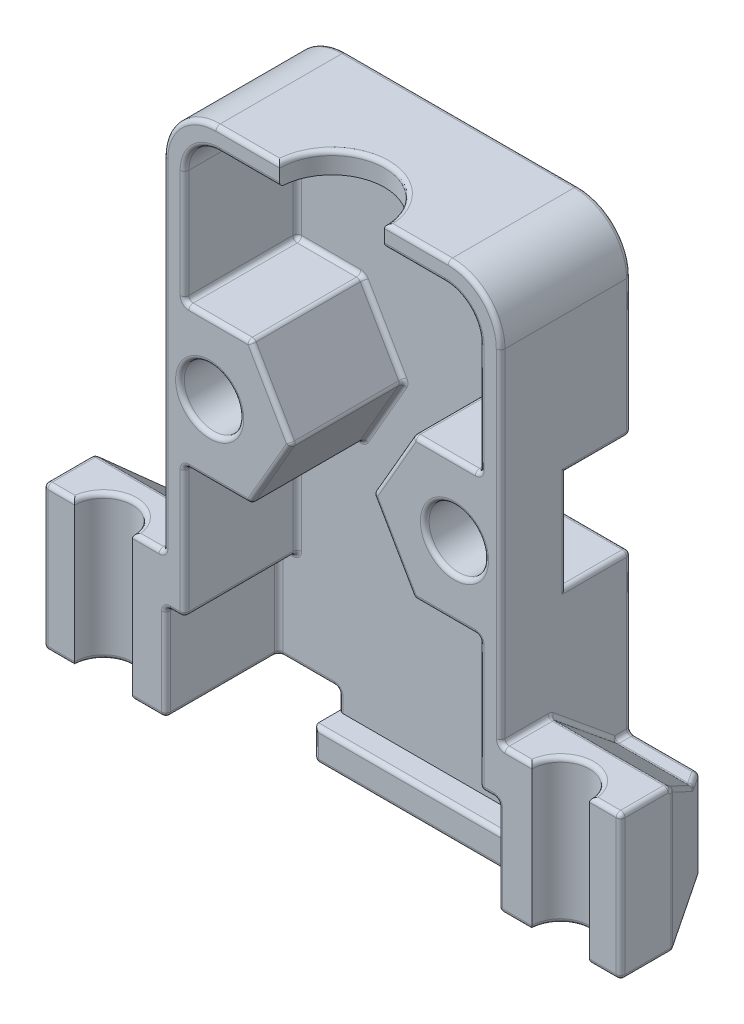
from build123d import *

# Parameters (mm, degrees)
EXTRUDE1_DEPTH      = 7.45
EXTRUDE2_DEPTH      = 31.906239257
EXTRUDE3_DEPTH      = 6.860458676
EXTRUDE4_DEPTH      = 6.860458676
EXTRUDE6_DEPTH      = 0.8
SKETCH6_R           = 1.65
SKETCH6_R_2         = 3
EXTRUDE7_DEPTH      = 39.254966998
SKETCH7_W           = 16.879082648
SKETCH7_H           = 29.6
EXTRUDE8_DEPTH      = 6.45
FILLET1_R           = 3
EXTRUDE9_DEPTH      = 7.45
EXTRUDE10_DEPTH     = 3.7
SKETCH12_R          = 1.7
EXTRUDE11_DEPTH     = 26.405019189
SKETCH_1_W          = 19
SKETCH_1_H          = 5.5
CUT_EXTRUDE_1_DEPTH = 6.45
FILLET_1_R          = 2
CUT_EXTRUDE_2_DEPTH = 36.726635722
CUT_EXTRUDE_3_DEPTH = 36.726635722
FILLET4_R           = 0.25


with BuildPart() as part:
    # Sketch1 → Extrude1 (new body)
    with BuildSketch(Plane.XY):
        Polygon((-16.5, -3.6), (-9.639541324, -3.6), (-9.639541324, 19.75), (9.639541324, 19.75), (9.639541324, -3.6), (16.5, -3.6), (16.5, -11.85), (6.075, -11.85), (6.075, -14.75), (-6.075, -14.75), (-6.075, -11.85), (-16.5, -11.85), align=None)
    extrude(amount=EXTRUDE1_DEPTH)

    # Sketch2 → Extrude2 (cut, through all)
    with BuildSketch(Plane.ZY.offset(6.075)):
        Polygon((7.45, -14.75), (2.4, -14.75), (2.4, -12.95), (1, -12.95), (1, -11.85), (2.4, -11.85), (7.45, -11.85), align=None)
    extrude(amount=-EXTRUDE2_DEPTH, mode=Mode.SUBTRACT)

    # Sketch3 → Extrude3 (cut)
    with BuildSketch(Plane.ZY.offset(16.5)):
        Polygon((0, -6.6), (1, -6.6), (4.65, -3.6), (0, -3.6), align=None)
    extrude(amount=-EXTRUDE3_DEPTH, mode=Mode.SUBTRACT)

    # Sketch4 → Extrude4 (cut)
    with BuildSketch(Plane(origin=(16.5, 0, 0), x_dir=(0, 0, -1), z_dir=(1, 0, 0))):
        Polygon((0, -6.6), (0, -3.6), (-4.65, -3.6), (-1, -6.6), align=None)
    extrude(amount=-EXTRUDE4_DEPTH, mode=Mode.SUBTRACT)

    # Sketch5 → Extrude6 (cut)
    with BuildSketch(Plane(origin=(0, 19.75, 0), x_dir=(1, 0, 0), z_dir=(0, 1, 0))):
        with BuildLine():
            ThreePointArc((-3.5, -7.45), (-2.474873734, -4.975126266), (0, -3.95))
            Line((0, -3.95), (0, 0))
            Line((0, 0), (-9.639541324, 0))
            Line((-9.639541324, 0), (-9.639541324, -7.45))
            Line((-9.639541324, -7.45), (-3.5, -7.45))
        make_face()
        with BuildLine():
            Line((0, 0), (0, -3.95))
            ThreePointArc((0, -3.95), (2.474873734, -4.975126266), (3.5, -7.45))
            Line((3.5, -7.45), (9.639541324, -7.45))
            Line((9.639541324, -7.45), (9.639541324, 0))
            Line((9.639541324, 0), (0, 0))
        make_face()
        with BuildLine():
            Line((-3, -7.45), (0, -7.45))
            Line((0, -7.45), (0, -4.45))
            ThreePointArc((0, -4.45), (-2.121320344, -5.328679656), (-3, -7.45))
        make_face()
        with BuildLine():
            Line((0, -4.45), (0, -7.45))
            Line((0, -7.45), (3, -7.45))
            ThreePointArc((3, -7.45), (2.121320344, -5.328679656), (0, -4.45))
        make_face()
        with BuildLine():
            Line((-3, -7.45), (0, -7.45))
            Line((0, -7.45), (0, -4.45))
            ThreePointArc((0, -4.45), (-2.121320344, -5.328679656), (-3, -7.45))
        make_face()
        with BuildLine():
            Line((0, -4.45), (0, -7.45))
            Line((0, -7.45), (3, -7.45))
            ThreePointArc((3, -7.45), (2.121320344, -5.328679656), (0, -4.45))
        make_face()
        with BuildLine():
            ThreePointArc((-3, -7.45), (-2.121320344, -5.328679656), (0, -4.45))
            Line((0, -4.45), (0, -3.95))
            ThreePointArc((0, -3.95), (-2.474873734, -4.975126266), (-3.5, -7.45))
            Line((-3.5, -7.45), (-3, -7.45))
        make_face()
        with BuildLine():
            Line((0, -3.95), (0, -4.45))
            ThreePointArc((0, -4.45), (2.121320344, -5.328679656), (3, -7.45))
            Line((3, -7.45), (3.5, -7.45))
            ThreePointArc((3.5, -7.45), (2.474873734, -4.975126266), (0, -3.95))
        make_face()
        with BuildLine():
            ThreePointArc((-3, -7.45), (-2.121320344, -5.328679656), (0, -4.45))
            Line((0, -4.45), (0, -3.95))
            ThreePointArc((0, -3.95), (-2.474873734, -4.975126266), (-3.5, -7.45))
            Line((-3.5, -7.45), (-3, -7.45))
        make_face()
        with BuildLine():
            Line((0, -3.95), (0, -4.45))
            ThreePointArc((0, -4.45), (2.121320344, -5.328679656), (3, -7.45))
            Line((3, -7.45), (3.5, -7.45))
            ThreePointArc((3.5, -7.45), (2.474873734, -4.975126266), (0, -3.95))
        make_face()
    extrude(amount=-EXTRUDE6_DEPTH, mode=Mode.SUBTRACT)

    # Sketch6 → Extrude7 (cut, through all)
    with BuildSketch(Plane(origin=(0, 18.95, 0), x_dir=(1, 0, 0), z_dir=(0, 1, 0))):
        with Locations((-13.069770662, -7.45)):
            Circle(SKETCH6_R)
        with Locations((0, -7.45)):
            Circle(SKETCH6_R_2)
        with Locations((13.069770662, -7.45)):
            Circle(SKETCH6_R)
    extrude(amount=-EXTRUDE7_DEPTH, mode=Mode.SUBTRACT)

    # Sketch7 → Extrude8 (cut)
    with BuildSketch(Plane.XY.offset(7.45)):
        with Locations((0, 2.95)):
            Rectangle(SKETCH7_W, SKETCH7_H)
    extrude(amount=-EXTRUDE8_DEPTH, mode=Mode.SUBTRACT)

    # Fillet1
    fillet1_edges = [part.edges().sort_by_distance(p)[0] for p in [
        (-9.639541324, 18.95, 3.725),
        (9.639541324, 18.95, 3.725),
    ]]
    fillet(fillet1_edges, radius=FILLET1_R)

    # Sketch10 → Extrude9 (add)
    with BuildSketch(Plane(origin=(0, 0, 0), x_dir=(-1, 0, 0), z_dir=(0, 0, -1))):
        Polygon((8.645448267, 2.4), (9.639541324, 2.4), (9.639541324, 8.1), (8.645448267, 8.1), (5.354551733, 8.1), (3.709103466, 5.25), (5.354551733, 2.4), align=None)
        Polygon((9.33826859, 1.2), (9.639541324, 1.2), (9.639541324, 2.4), (8.645448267, 2.4), (5.354551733, 2.4), (3.709103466, 5.25), (5.354551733, 8.1), (8.645448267, 8.1), (9.639541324, 8.1), (9.639541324, 9.3), (9.33826859, 9.3), (4.66173141, 9.3), (2.32346282, 5.25), (4.66173141, 1.2), align=None)
        Polygon((-5.354551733, 8.1), (-3.709103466, 5.25), (-5.354551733, 2.4), (-8.645448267, 2.4), (-9.639541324, 2.4), (-9.639541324, 1.2), (-9.33826859, 1.2), (-4.66173141, 1.2), (-2.32346282, 5.25), (-4.66173141, 9.3), (-9.33826859, 9.3), (-9.639541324, 9.3), (-9.639541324, 8.1), (-8.645448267, 8.1), align=None)
        Polygon((-5.354551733, 2.4), (-3.709103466, 5.25), (-5.354551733, 8.1), (-8.645448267, 8.1), (-9.639541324, 8.1), (-9.639541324, 2.4), (-8.645448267, 2.4), align=None)
    extrude(amount=-EXTRUDE9_DEPTH)

    # Sketch11 → Extrude10 (cut)
    with BuildSketch(Plane(origin=(0, 0, 0), x_dir=(-1, 0, 0), z_dir=(0, 0, -1))):
        Polygon((-9.639541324, 8.1), (-5.354551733, 8.1), (-3.709103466, 5.25), (-5.354551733, 2.4), (-9.639541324, 2.4), align=None)
        Polygon((9.639541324, 8.1), (9.639541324, 2.4), (5.354551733, 2.4), (3.709103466, 5.25), (5.354551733, 8.1), align=None)
    extrude(amount=-EXTRUDE10_DEPTH, mode=Mode.SUBTRACT)

    # Sketch12 → Extrude11 (cut, through all)
    with BuildSketch(Plane(origin=(0, 0, 3.7), x_dir=(-1, 0, 0), z_dir=(0, 0, -1))):
        with Locations((-7, 5.25)):
            Circle(SKETCH12_R)
        with Locations((7, 5.25)):
            Circle(SKETCH12_R)
    extrude(amount=-EXTRUDE11_DEPTH, mode=Mode.SUBTRACT)

    # Sketch 1 → Cut-Extrude 1 (cut)
    with BuildSketch(Plane.XY.offset(7.45)):
        with Locations((0, -9.1)):
            Rectangle(SKETCH_1_W, SKETCH_1_H)
    extrude(amount=-CUT_EXTRUDE_1_DEPTH, mode=Mode.SUBTRACT)

    # Fillet 1
    fillet_1_edges = [part.edges().sort_by_distance(p)[0] for p in [
        (-8.439541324, 17.75, 4.225),
        (8.439541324, 17.75, 4.225),
    ]]
    fillet(fillet_1_edges, radius=FILLET_1_R)

    # Sketch 2 → Cut-Extrude 2 (cut, through all)
    with BuildSketch(Plane.XZ.offset(11.85)):
        Polygon((16.5, 0), (16.5, 4.5), (13.5, 0), align=None)
    extrude(amount=-CUT_EXTRUDE_2_DEPTH, mode=Mode.SUBTRACT)

    # Sketch 3 → Cut-Extrude 3 (cut, through all)
    with BuildSketch(Plane.XZ.offset(11.85)):
        Polygon((-16.5, 0), (-16.5, 4.5), (-13.5, 0), align=None)
    extrude(amount=-CUT_EXTRUDE_3_DEPTH, mode=Mode.SUBTRACT)

    # Fillet4
    fillet4_edges = [part.edges().sort_by_distance(p)[0] for p in [
        (4.719770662, 17.75, 7.45),
        (7.853754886, 17.164213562, 7.45),
        (8.439541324, 12.525, 7.45),
        (4.819770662, 18.95, 7.45),
        (6.550636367, 9.3, 7.45),
        (8.760861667, 18.071320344, 7.45),
        (3.492597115, 7.275, 7.45),
        (9.639541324, 6.175, 7.45),
        (3.492597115, 3.225, 7.45),
        (10.529655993, -3.6, 7.45),
        (6.550636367, 1.2, 7.45),
        (8.439541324, -2.575, 7.45),
        (10.459885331, -11.85, 7.45),
        (8.969770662, -6.35, 7.45),
        (9.5, -9.1, 7.45),
        (8.7, 5.25, 7.45),
        (-4.719770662, 17.75, 7.45),
        (0, 17.75, 1),
        (7.853754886, 17.164213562, 1),
        (0, 18.95, 4.45),
        (8.439541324, 9.3, 4.225),
        (8.439541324, 12.525, 1),
        (0, 18.95, 0),
        (-4.819770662, 18.95, 7.45),
        (6.550636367, 9.3, 1),
        (4.66173141, 9.3, 4.225),
        (8.760861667, 18.071320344, 0),
        (3.492597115, 7.275, 1),
        (2.32346282, 5.25, 4.225),
        (9.639541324, 12.025, 0),
        (9.639541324, 8.1, 1.85),
        (9.639541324, 5.25, 3.7),
        (9.639541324, 2.4, 1.85),
        (9.639541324, -0.6, 0),
        (9.639541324, -5.1, 0),
        (9.639541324, -6.6, 0.5),
        (9.639541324, -5.1, 2.825),
        (9.639541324, -3.6, 6.05),
        (3.492597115, 3.225, 1),
        (4.66173141, 1.2, 4.225),
        (16.5, -3.6, 6.05),
        (15.609885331, -3.6, 7.45),
        (13.069770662, -3.6, 5.8),
        (13.069770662, -3.6, 4.65),
        (8.439541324, 1.2, 4.225),
        (6.550636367, 1.2, 1),
        (13.069770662, -11.85, 5.8),
        (8.439541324, -6.35, 4.225),
        (8.439541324, -2.575, 1),
        (9.5, -11.85, 4.225),
        (15.609885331, -11.85, 7.45),
        (16.5, -11.85, 5.975),
        (15, -11.85, 2.25),
        (9.7875, -11.85, 0),
        (6.075, -11.85, 0.5),
        (7.7875, -11.85, 1),
        (9.5, -6.35, 4.225),
        (8.969770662, -6.35, 1),
        (9.5, -9.1, 1),
        (-8.439541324, 12.525, 7.45),
        (-7.853754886, 17.164213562, 7.45),
        (-6.550636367, 9.3, 7.45),
        (-3.492597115, 7.275, 7.45),
        (-3.492597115, 3.225, 7.45),
        (-6.550636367, 1.2, 7.45),
        (-8.760861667, 18.071320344, 7.45),
        (-8.439541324, -2.575, 7.45),
        (-9.639541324, 6.175, 7.45),
        (-8.969770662, -6.35, 7.45),
        (-10.529655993, -3.6, 7.45),
        (-9.5, -9.1, 7.45),
        (-10.459885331, -11.85, 7.45),
        (-5.3, 5.25, 7.45),
        (-7.853754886, 17.164213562, 1),
        (-8.439541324, 12.525, 1),
        (-6.550636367, 9.3, 1),
        (-3.492597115, 7.275, 1),
        (-3.492597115, 3.225, 1),
        (-6.550636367, 1.2, 1),
        (-8.439541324, -2.575, 1),
        (-8.969770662, -6.35, 1),
        (-9.5, -9.1, 1),
        (-7.7875, -11.85, 1),
        (-6.075, -12.4, 1),
        (6.075, -12.4, 1),
        (-9.639541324, 12.625, 0),
        (-9.639541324, 8.7, 0),
        (-7.497046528, 8.1, 0),
        (-4.531827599, 6.675, 0),
        (-4.531827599, 3.825, 0),
        (-7.497046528, 2.4, 0),
        (-9.639541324, 1.8, 0),
        (-9.639541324, -2.7, 0),
        (-11.569770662, -6.6, 0),
        (-13.5, -9.225, 0),
        (-9.7875, -11.85, 0),
        (-6.075, -13.3, 0),
        (0, -14.75, 0),
        (6.075, -13.3, 0),
        (13.5, -9.225, 0),
        (11.569770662, -6.6, 0),
        (7.497046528, 2.4, 0),
        (4.531827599, 3.825, 0),
        (4.531827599, 6.675, 0),
        (7.497046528, 8.1, 0),
        (-8.760861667, 18.071320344, 0),
        (13.833333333, -6.6, 0.5),
        (11.903103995, -6.6, 1),
        (16.5, -3.661643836, 4.575),
        (15.333333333, -5.161643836, 2.75),
        (16.5, -7.786643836, 4.5),
        (16.5, -7.725, 7.45),
        (6.075, -14.75, 1.2),
        (6.075, -13.85, 2.4),
        (-8.439541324, 9.3, 4.225),
        (-4.66173141, 9.3, 4.225),
        (-2.32346282, 5.25, 4.225),
        (-4.66173141, 1.2, 4.225),
        (-8.439541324, 1.2, 4.225),
        (-8.439541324, -6.35, 4.225),
        (-9.639541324, -3.6, 6.05),
        (-9.639541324, -5.1, 2.825),
        (-9.639541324, -6.6, 0.5),
        (-9.639541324, 2.4, 1.85),
        (-9.639541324, 5.25, 3.7),
        (-9.639541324, 8.1, 1.85),
        (-9.5, -6.35, 4.225),
        (-13.069770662, -3.6, 4.65),
        (-13.069770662, -3.6, 5.8),
        (-15.609885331, -3.6, 7.45),
        (-16.5, -3.6, 6.05),
        (-9.5, -11.85, 4.225),
        (-13.069770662, -11.85, 5.8),
        (-15, -11.85, 2.25),
        (-16.5, -11.85, 5.975),
        (-15.609885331, -11.85, 7.45),
        (-6.075, -11.85, 0.5),
        (-6.075, -13.85, 2.4),
        (-6.075, -14.75, 1.2),
        (0, -12.95, 2.4),
        (-13.833333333, -6.6, 0.5),
        (-15.333333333, -5.161643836, 2.75),
        (-16.5, -7.786643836, 4.5),
        (0, -14.75, 2.4),
        (-16.5, -3.661643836, 4.575),
        (-16.5, -7.725, 7.45),
    ]]
    fillet(fillet4_edges, radius=FILLET4_R)


solid = part.part
